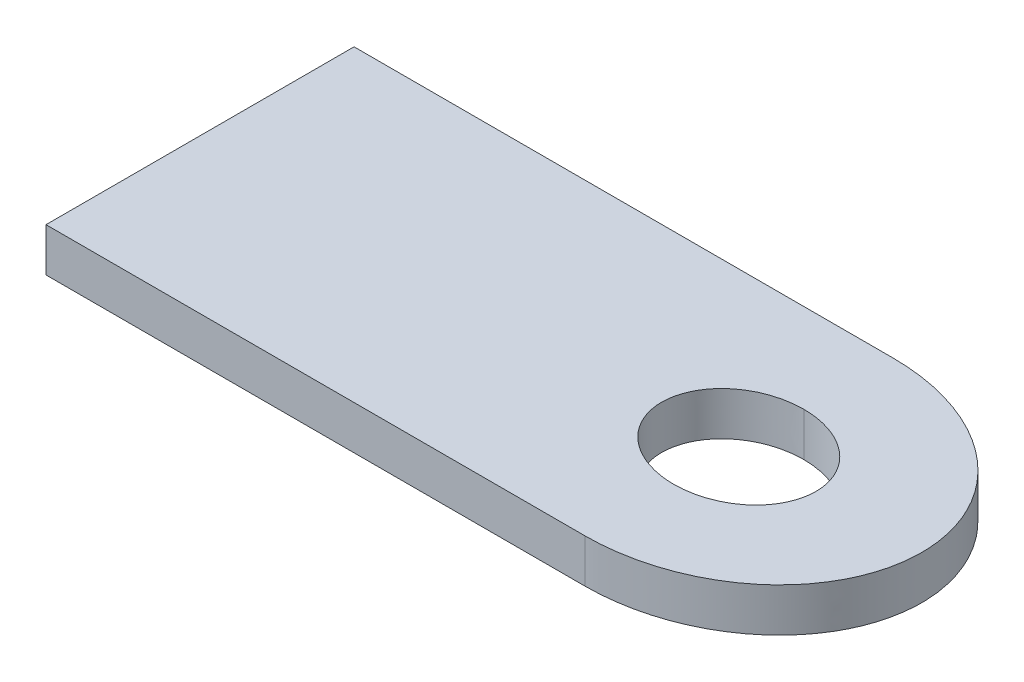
ISO-10303-21;
HEADER;
FILE_DESCRIPTION(('STEP AP214'),'2;1');
FILE_NAME('part.step','',(''),(''),'','','');
FILE_SCHEMA(('AUTOMOTIVE_DESIGN { 1 0 10303 214 1 1 1 1 }'));
ENDSEC;
DATA;
#1=APPLICATION_CONTEXT('core data for automotive mechanical design processes');
#2=APPLICATION_PROTOCOL_DEFINITION('international standard','automotive_design',2000,#1);
#3=PRODUCT_CONTEXT('',#1,'mechanical');
#4=PRODUCT('Part','Part','',(#3));
#5=PRODUCT_RELATED_PRODUCT_CATEGORY('part','',(#4));
#6=PRODUCT_DEFINITION_FORMATION('','',#4);
#7=PRODUCT_DEFINITION_CONTEXT('part definition',#1,'design');
#8=PRODUCT_DEFINITION('design','',#6,#7);
#9=PRODUCT_DEFINITION_SHAPE('','',#8);
#10=(LENGTH_UNIT() NAMED_UNIT(*) SI_UNIT(.MILLI.,.METRE.));
#11=(NAMED_UNIT(*) PLANE_ANGLE_UNIT() SI_UNIT($,.RADIAN.));
#12=(NAMED_UNIT(*) SI_UNIT($,.STERADIAN.) SOLID_ANGLE_UNIT());
#13=UNCERTAINTY_MEASURE_WITH_UNIT(LENGTH_MEASURE(1.E-05),#10,'distance_accuracy_value','');
#14=(GEOMETRIC_REPRESENTATION_CONTEXT(3) GLOBAL_UNCERTAINTY_ASSIGNED_CONTEXT((#13)) GLOBAL_UNIT_ASSIGNED_CONTEXT((#10,
#11,#12)) REPRESENTATION_CONTEXT('',''));
#15=CARTESIAN_POINT('',(0.,0.,0.));
#16=DIRECTION('',(0.,0.,1.));
#17=DIRECTION('',(1.,0.,0.));
#18=AXIS2_PLACEMENT_3D('',#15,#16,#17);
#19=CARTESIAN_POINT('',(68.9071258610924,10.,13.6261901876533));
#20=CARTESIAN_POINT('',(68.9071258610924,6.66666666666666,13.6261901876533));
#21=CARTESIAN_POINT('',(68.9071258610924,3.33333333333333,13.6261901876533));
#22=CARTESIAN_POINT('',(68.9071258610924,0.,13.6261901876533));
#23=CARTESIAN_POINT('',(65.8746050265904,10.,13.625383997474));
#24=CARTESIAN_POINT('',(65.8744519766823,6.66666666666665,13.6252988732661));
#25=CARTESIAN_POINT('',(65.8724623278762,3.33333333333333,13.6241922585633));
#26=CARTESIAN_POINT('',(65.8759824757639,0.,13.6261501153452));
#27=CARTESIAN_POINT('',(61.3629464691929,10.,12.6570491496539));
#28=CARTESIAN_POINT('',(61.3629343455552,6.66666666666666,12.6570424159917));
#29=CARTESIAN_POINT('',(61.3627767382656,3.33333333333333,12.6569548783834));
#30=CARTESIAN_POINT('',(61.3630555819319,0.,12.6571097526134));
#31=CARTESIAN_POINT('',(55.9835863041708,10.,9.24417294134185));
#32=CARTESIAN_POINT('',(55.9835892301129,6.66666666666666,9.2441745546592));
#33=CARTESIAN_POINT('',(55.9836272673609,3.33333333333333,9.24419552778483));
#34=CARTESIAN_POINT('',(55.9835599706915,0.,9.24415842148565));
#35=CARTESIAN_POINT('',(52.3400544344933,10.,5.03294937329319));
#36=CARTESIAN_POINT('',(52.340052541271,6.66666666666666,5.03294839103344));
#37=CARTESIAN_POINT('',(52.3400279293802,3.33333333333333,5.03293562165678));
#38=CARTESIAN_POINT('',(52.3400714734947,0.,5.03295821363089));
#39=CARTESIAN_POINT('',(50.538901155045,10.,-1.29647435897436));
#40=CARTESIAN_POINT('',(50.5389021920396,6.66666666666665,-1.29647435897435));
#41=CARTESIAN_POINT('',(50.5389156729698,3.33333333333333,-1.29647435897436));
#42=CARTESIAN_POINT('',(50.5388918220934,0.,-1.29647435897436));
#43=CARTESIAN_POINT('',(52.3400544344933,10.,-7.62589809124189));
#44=CARTESIAN_POINT('',(52.3400525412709,6.66666666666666,-7.62589710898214));
#45=CARTESIAN_POINT('',(52.3400279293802,3.33333333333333,-7.62588433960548));
#46=CARTESIAN_POINT('',(52.3400714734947,0.,-7.62590693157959));
#47=CARTESIAN_POINT('',(55.9835863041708,10.,-11.8371216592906));
#48=CARTESIAN_POINT('',(55.9835892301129,6.66666666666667,-11.8371232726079));
#49=CARTESIAN_POINT('',(55.9836272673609,3.33333333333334,-11.8371442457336));
#50=CARTESIAN_POINT('',(55.9835599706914,0.,-11.8371071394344));
#51=CARTESIAN_POINT('',(61.3629464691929,10.,-15.2499978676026));
#52=CARTESIAN_POINT('',(61.3629343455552,6.66666666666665,-15.2499911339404));
#53=CARTESIAN_POINT('',(61.3627767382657,3.33333333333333,-15.2499035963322));
#54=CARTESIAN_POINT('',(61.3630555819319,0.,-15.2500584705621));
#55=CARTESIAN_POINT('',(65.8746050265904,10.,-16.2183327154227));
#56=CARTESIAN_POINT('',(65.8744519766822,6.66666666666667,-16.2182475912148));
#57=CARTESIAN_POINT('',(65.8724623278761,3.33333333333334,-16.217140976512));
#58=CARTESIAN_POINT('',(65.8759824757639,0.,-16.2190988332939));
#59=CARTESIAN_POINT('',(68.9071258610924,10.,-16.219138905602));
#60=CARTESIAN_POINT('',(68.9071258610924,6.66666666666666,-16.219138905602));
#61=CARTESIAN_POINT('',(68.9071258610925,3.33333333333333,-16.219138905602));
#62=CARTESIAN_POINT('',(68.9071258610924,0.,-16.219138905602));
#63=B_SPLINE_SURFACE_WITH_KNOTS('',3,3,((#19,#20,#21,#22),(#23,#24,#25,#26),(#27,#28,#29,#30),
(#31,#32,#33,#34),(#35,#36,#37,#38),(#39,#40,#41,#42),(#43,#44,#45,#46),(#47,#48,#49,#50),(#51,
#52,#53,#54),(#55,#56,#57,#58),(#59,#60,#61,#62)),.UNSPECIFIED.,.F.,.F.,.F.,(4,1,1,1,1,1,1,1,4),
(4,4),(0.,0.178093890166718,0.263499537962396,0.370459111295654,0.5,0.629540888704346,
0.736500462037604,0.821906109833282,1.),(0.,1.),.UNSPECIFIED.);
#64=CARTESIAN_POINT('',(68.9071258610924,9.99999999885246,-16.219138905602));
#65=CARTESIAN_POINT('',(65.8746050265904,9.99999999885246,-16.2183327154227));
#66=CARTESIAN_POINT('',(61.3629464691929,9.99999999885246,-15.2499978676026));
#67=CARTESIAN_POINT('',(55.9835863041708,9.99999999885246,-11.8371216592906));
#68=CARTESIAN_POINT('',(52.3400544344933,9.99999999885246,-7.62589809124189));
#69=CARTESIAN_POINT('',(50.538901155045,9.99999999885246,-1.29647435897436));
#70=CARTESIAN_POINT('',(52.3400544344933,9.99999999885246,5.03294937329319));
#71=CARTESIAN_POINT('',(55.9835863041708,9.99999999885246,9.24417294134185));
#72=CARTESIAN_POINT('',(61.3629464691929,9.99999999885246,12.6570491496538));
#73=CARTESIAN_POINT('',(65.8746050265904,9.99999999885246,13.6253839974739));
#74=CARTESIAN_POINT('',(68.9071258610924,9.99999999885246,13.6261901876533));
#75=B_SPLINE_CURVE_WITH_KNOTS('',3,(#64,#65,#66,#67,#68,#69,#70,#71,#72,#73,#74),.UNSPECIFIED.,
.F.,.F.,(4,1,1,1,1,1,1,1,4),(0.,0.178093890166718,0.263499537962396,0.370459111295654,0.5,
0.629540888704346,0.736500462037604,0.821906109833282,1.),.UNSPECIFIED.);
#76=CARTESIAN_POINT('',(68.9071258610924,10.,-16.219138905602));
#77=VERTEX_POINT('',#76);
#78=CARTESIAN_POINT('',(68.9071258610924,10.,13.6261901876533));
#79=VERTEX_POINT('',#78);
#80=EDGE_CURVE('E13',#77,#79,#75,.T.);
#81=DIRECTION('',(0.,-1.,0.));
#82=VECTOR('',#81,1.);
#83=CARTESIAN_POINT('',(68.9071258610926,4.99999999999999,13.6261901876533));
#84=LINE('',#83,#82);
#85=CARTESIAN_POINT('',(68.9071258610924,0.,13.6261901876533));
#86=VERTEX_POINT('',#85);
#87=EDGE_CURVE('E154',#79,#86,#84,.T.);
#88=CARTESIAN_POINT('',(68.9071258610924,3.40516326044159E-08,13.6261901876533));
#89=CARTESIAN_POINT('',(65.8759824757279,3.40516326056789E-08,13.6261501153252));
#90=CARTESIAN_POINT('',(61.363055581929,3.40516326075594E-08,12.6571097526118));
#91=CARTESIAN_POINT('',(55.9835599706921,3.40516326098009E-08,9.24415842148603));
#92=CARTESIAN_POINT('',(52.3400714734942,3.40516326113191E-08,5.03295821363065));
#93=CARTESIAN_POINT('',(50.5388918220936,3.40516326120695E-08,-1.29647435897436));
#94=CARTESIAN_POINT('',(52.3400714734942,3.4051632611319E-08,-7.62590693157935));
#95=CARTESIAN_POINT('',(55.9835599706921,3.40516326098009E-08,-11.8371071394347));
#96=CARTESIAN_POINT('',(61.363055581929,3.40516326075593E-08,-15.2500584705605));
#97=CARTESIAN_POINT('',(65.8759824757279,3.4051632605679E-08,-16.2190988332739));
#98=CARTESIAN_POINT('',(68.9071258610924,3.40516326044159E-08,-16.219138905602));
#99=B_SPLINE_CURVE_WITH_KNOTS('',3,(#88,#89,#90,#91,#92,#93,#94,#95,#96,#97,#98),.UNSPECIFIED.,
.F.,.F.,(4,1,1,1,1,1,1,1,4),(0.,0.178093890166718,0.263499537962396,0.370459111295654,0.5,
0.629540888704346,0.736500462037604,0.821906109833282,1.),.UNSPECIFIED.);
#100=CARTESIAN_POINT('',(68.9071258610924,0.,-16.219138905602));
#101=VERTEX_POINT('',#100);
#102=EDGE_CURVE('E224',#101,#86,#99,.F.);
#103=DIRECTION('',(0.,-1.,0.));
#104=VECTOR('',#103,1.);
#105=CARTESIAN_POINT('',(68.9071258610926,4.99999999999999,-16.2191389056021));
#106=LINE('',#105,#104);
#107=EDGE_CURVE('E378',#77,#101,#106,.T.);
#108=ORIENTED_EDGE('',*,*,#80,.T.);
#109=ORIENTED_EDGE('',*,*,#87,.T.);
#110=ORIENTED_EDGE('',*,*,#102,.F.);
#111=ORIENTED_EDGE('',*,*,#107,.F.);
#112=EDGE_LOOP('',(#108,#109,#110,#111));
#113=FACE_BOUND('',#112,.T.);
#114=ADVANCED_FACE('F142',(#113),#63,.F.);
#115=CARTESIAN_POINT('',(61.1935897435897,10.,-1.29647435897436));
#116=DIRECTION('',(0.,1.,0.));
#117=DIRECTION('',(0.,0.,1.));
#118=AXIS2_PLACEMENT_3D('',#115,#116,#117);
#119=PLANE('',#118);
#120=DIRECTION('',(0.,0.,1.));
#121=VECTOR('',#120,1.);
#122=CARTESIAN_POINT('',(-54.7391864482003,9.99999999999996,-1.29647435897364));
#123=LINE('',#122,#121);
#124=CARTESIAN_POINT('',(-54.7391864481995,10.,-36.6470085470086));
#125=VERTEX_POINT('',#124);
#126=CARTESIAN_POINT('',(-54.7391864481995,10.,34.0540598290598));
#127=VERTEX_POINT('',#126);
#128=EDGE_CURVE('E227',#125,#127,#123,.T.);
#129=ORIENTED_EDGE('',*,*,#128,.T.);
#130=DIRECTION('',(1.,0.,0.));
#131=VECTOR('',#130,1.);
#132=CARTESIAN_POINT('',(7.08396970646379,9.99999999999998,34.0540598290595));
#133=LINE('',#132,#131);
#134=CARTESIAN_POINT('',(68.9071258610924,10.,34.0540598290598));
#135=VERTEX_POINT('',#134);
#136=EDGE_CURVE('E204',#127,#135,#133,.T.);
#137=ORIENTED_EDGE('',*,*,#136,.T.);
#138=CARTESIAN_POINT('',(68.9071258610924,9.99999999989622,-36.6470085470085));
#139=CARTESIAN_POINT('',(74.7994223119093,9.99999999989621,-36.6468387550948));
#140=CARTESIAN_POINT('',(85.469885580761,9.99999999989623,-34.7650812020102));
#141=CARTESIAN_POINT('',(97.0860499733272,9.99999999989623,-28.1613458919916));
#142=CARTESIAN_POINT('',(103.932171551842,9.99999999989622,-21.2199386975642));
#143=CARTESIAN_POINT('',(107.895508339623,9.99999999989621,-15.0546870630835));
#144=CARTESIAN_POINT('',(110.35303853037,9.99999999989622,-8.32354724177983));
#145=CARTESIAN_POINT('',(111.186375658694,9.99999999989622,-1.29647435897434));
#146=CARTESIAN_POINT('',(110.35303853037,9.99999999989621,5.73059852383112));
#147=CARTESIAN_POINT('',(107.895508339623,9.99999999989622,12.4617383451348));
#148=CARTESIAN_POINT('',(103.932171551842,9.99999999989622,18.6269899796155));
#149=CARTESIAN_POINT('',(97.0860499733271,9.99999999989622,25.5683971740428));
#150=CARTESIAN_POINT('',(85.4698855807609,9.99999999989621,32.1721324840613));
#151=CARTESIAN_POINT('',(74.7994223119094,9.99999999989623,34.0538900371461));
#152=CARTESIAN_POINT('',(68.9071258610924,9.99999999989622,34.0540598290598));
#153=B_SPLINE_CURVE_WITH_KNOTS('',3,(#138,#139,#140,#141,#142,#143,#144,#145,#146,#147,#148,
#149,#150,#151,#152),.UNSPECIFIED.,.F.,.F.,(4,1,1,1,1,1,1,1,1,1,1,1,4),(0.,0.145372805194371,
0.263093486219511,0.324673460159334,0.384370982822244,0.442591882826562,0.5,0.557408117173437,
0.615629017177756,0.675326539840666,0.736906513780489,0.854627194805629,1.),.UNSPECIFIED.);
#154=CARTESIAN_POINT('',(68.9071258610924,10.,-36.6470085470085));
#155=VERTEX_POINT('',#154);
#156=EDGE_CURVE('E367',#135,#155,#153,.F.);
#157=ORIENTED_EDGE('',*,*,#156,.T.);
#158=DIRECTION('',(-1.,0.,0.));
#159=VECTOR('',#158,1.);
#160=CARTESIAN_POINT('',(7.08396970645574,9.99999999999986,-36.6470085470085));
#161=LINE('',#160,#159);
#162=EDGE_CURVE('E373',#155,#125,#161,.T.);
#163=ORIENTED_EDGE('',*,*,#162,.T.);
#164=EDGE_LOOP('',(#129,#137,#157,#163));
#165=FACE_BOUND('',#164,.T.);
#166=ORIENTED_EDGE('',*,*,#80,.F.);
#167=CARTESIAN_POINT('',(68.9071258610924,9.99999999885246,13.6261901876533));
#168=CARTESIAN_POINT('',(71.9396466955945,9.99999999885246,13.625383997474));
#169=CARTESIAN_POINT('',(76.4513052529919,9.99999999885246,12.6570491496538));
#170=CARTESIAN_POINT('',(81.830665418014,9.99999999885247,9.24417294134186));
#171=CARTESIAN_POINT('',(85.4741972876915,9.99999999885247,5.03294937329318));
#172=CARTESIAN_POINT('',(87.2753505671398,9.99999999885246,-1.29647435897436));
#173=CARTESIAN_POINT('',(85.4741972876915,9.99999999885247,-7.6258980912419));
#174=CARTESIAN_POINT('',(81.830665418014,9.99999999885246,-11.8371216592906));
#175=CARTESIAN_POINT('',(76.4513052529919,9.99999999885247,-15.2499978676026));
#176=CARTESIAN_POINT('',(71.9396466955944,9.99999999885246,-16.2183327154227));
#177=CARTESIAN_POINT('',(68.9071258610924,9.99999999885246,-16.219138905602));
#178=B_SPLINE_CURVE_WITH_KNOTS('',3,(#167,#168,#169,#170,#171,#172,#173,#174,#175,#176,#177),
.UNSPECIFIED.,.F.,.F.,(4,1,1,1,1,1,1,1,4),(0.,0.178093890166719,0.263499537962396,
0.370459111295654,0.5,0.629540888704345,0.736500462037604,0.821906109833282,1.),.UNSPECIFIED.);
#179=EDGE_CURVE('E305',#79,#77,#178,.T.);
#180=ORIENTED_EDGE('',*,*,#179,.F.);
#181=EDGE_LOOP('',(#166,#180));
#182=FACE_BOUND('',#181,.T.);
#183=ADVANCED_FACE('F247',(#165,#182),#119,.T.);
#184=CARTESIAN_POINT('',(61.1935897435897,0.,-1.29647435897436));
#185=DIRECTION('',(0.,1.,0.));
#186=DIRECTION('',(0.,0.,1.));
#187=AXIS2_PLACEMENT_3D('',#184,#185,#186);
#188=PLANE('',#187);
#189=DIRECTION('',(0.,0.,1.));
#190=VECTOR('',#189,1.);
#191=CARTESIAN_POINT('',(-54.7391864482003,0.,-1.29647435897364));
#192=LINE('',#191,#190);
#193=CARTESIAN_POINT('',(-54.7391864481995,0.,-36.6470085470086));
#194=VERTEX_POINT('',#193);
#195=CARTESIAN_POINT('',(-54.7391864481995,0.,34.0540598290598));
#196=VERTEX_POINT('',#195);
#197=EDGE_CURVE('E216',#194,#196,#192,.T.);
#198=ORIENTED_EDGE('',*,*,#197,.F.);
#199=DIRECTION('',(-1.,0.,0.));
#200=VECTOR('',#199,1.);
#201=CARTESIAN_POINT('',(7.08396970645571,0.,-36.6470085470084));
#202=LINE('',#201,#200);
#203=CARTESIAN_POINT('',(68.9071258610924,0.,-36.6470085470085));
#204=VERTEX_POINT('',#203);
#205=EDGE_CURVE('E299',#204,#194,#202,.T.);
#206=ORIENTED_EDGE('',*,*,#205,.F.);
#207=CARTESIAN_POINT('',(68.9071258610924,2.27469374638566E-09,34.0540598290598));
#208=CARTESIAN_POINT('',(74.7978420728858,2.27469374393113E-09,34.0541377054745));
#209=CARTESIAN_POINT('',(85.4703612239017,2.27469373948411E-09,32.172057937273));
#210=CARTESIAN_POINT('',(97.0860485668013,2.2746937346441E-09,25.568397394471));
#211=CARTESIAN_POINT('',(103.932171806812,2.27469373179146E-09,18.6269899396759));
#212=CARTESIAN_POINT('',(107.895508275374,2.27469373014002E-09,12.4617383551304));
#213=CARTESIAN_POINT('',(110.35303854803,2.27469372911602E-09,5.73059852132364));
#214=CARTESIAN_POINT('',(111.186375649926,2.27469372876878E-09,-1.29647435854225));
#215=CARTESIAN_POINT('',(110.35303854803,2.27469372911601E-09,-8.32354724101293));
#216=CARTESIAN_POINT('',(107.895508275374,2.27469373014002E-09,-15.0546870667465));
#217=CARTESIAN_POINT('',(103.932171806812,2.27469373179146E-09,-21.2199386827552));
#218=CARTESIAN_POINT('',(97.0860485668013,2.27469373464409E-09,-28.1613459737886));
#219=CARTESIAN_POINT('',(85.4703612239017,2.27469373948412E-09,-34.7650535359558));
#220=CARTESIAN_POINT('',(74.7978420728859,2.27469374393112E-09,-36.6469306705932));
#221=CARTESIAN_POINT('',(68.9071258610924,2.27469374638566E-09,-36.6470085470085));
#222=B_SPLINE_CURVE_WITH_KNOTS('',3,(#207,#208,#209,#210,#211,#212,#213,#214,#215,#216,#217,
#218,#219,#220,#221),.UNSPECIFIED.,.F.,.F.,(4,1,1,1,1,1,1,1,1,1,1,1,4),(0.,0.145372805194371,
0.263093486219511,0.324673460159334,0.384370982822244,0.442591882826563,0.5,0.557408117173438,
0.615629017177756,0.675326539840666,0.736906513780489,0.854627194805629,1.),.UNSPECIFIED.);
#223=CARTESIAN_POINT('',(68.9071258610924,0.,34.0540598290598));
#224=VERTEX_POINT('',#223);
#225=EDGE_CURVE('E209',#224,#204,#222,.T.);
#226=ORIENTED_EDGE('',*,*,#225,.F.);
#227=DIRECTION('',(1.,0.,0.));
#228=VECTOR('',#227,1.);
#229=CARTESIAN_POINT('',(7.08396970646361,0.,34.0540598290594));
#230=LINE('',#229,#228);
#231=EDGE_CURVE('E202',#196,#224,#230,.T.);
#232=ORIENTED_EDGE('',*,*,#231,.F.);
#233=EDGE_LOOP('',(#198,#206,#226,#232));
#234=FACE_BOUND('',#233,.T.);
#235=ORIENTED_EDGE('',*,*,#102,.T.);
#236=CARTESIAN_POINT('',(68.9071258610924,3.4140046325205E-08,-16.219138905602));
#237=CARTESIAN_POINT('',(71.938269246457,3.41400463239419E-08,-16.2190988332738));
#238=CARTESIAN_POINT('',(76.4511961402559,3.41400463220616E-08,-15.2500584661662));
#239=CARTESIAN_POINT('',(81.8306917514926,3.41400463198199E-08,-11.837107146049));
#240=CARTESIAN_POINT('',(85.4741802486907,3.41400463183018E-08,-7.62590689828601));
#241=CARTESIAN_POINT('',(87.2753599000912,3.41400463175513E-08,-1.29647463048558));
#242=CARTESIAN_POINT('',(85.4741802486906,3.41400463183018E-08,5.03295917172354));
#243=CARTESIAN_POINT('',(81.8306917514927,3.414004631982E-08,9.24415689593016));
#244=CARTESIAN_POINT('',(76.4511961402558,3.41400463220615E-08,12.6571160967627));
#245=CARTESIAN_POINT('',(71.938269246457,3.4140046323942E-08,13.6262302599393));
#246=CARTESIAN_POINT('',(68.9071258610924,3.4140046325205E-08,13.6261901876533));
#247=B_SPLINE_CURVE_WITH_KNOTS('',3,(#236,#237,#238,#239,#240,#241,#242,#243,#244,#245,#246),
.UNSPECIFIED.,.F.,.F.,(4,1,1,1,1,1,1,1,4),(0.,0.178093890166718,0.263499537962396,
0.370459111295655,0.5,0.629540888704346,0.736500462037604,0.821906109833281,1.),.UNSPECIFIED.);
#248=EDGE_CURVE('E221',#86,#101,#247,.F.);
#249=ORIENTED_EDGE('',*,*,#248,.T.);
#250=EDGE_LOOP('',(#235,#249));
#251=FACE_BOUND('',#250,.T.);
#252=ADVANCED_FACE('F213',(#234,#251),#188,.F.);
#253=CARTESIAN_POINT('',(-54.7391864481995,0.,34.0540598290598));
#254=DIRECTION('',(1.,0.,0.));
#255=DIRECTION('',(0.,0.,-1.));
#256=AXIS2_PLACEMENT_3D('',#253,#254,#255);
#257=PLANE('',#256);
#258=ORIENTED_EDGE('',*,*,#197,.T.);
#259=DIRECTION('',(0.,-1.,0.));
#260=VECTOR('',#259,1.);
#261=CARTESIAN_POINT('',(-54.7391864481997,4.99999999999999,34.0540598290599));
#262=LINE('',#261,#260);
#263=EDGE_CURVE('E199',#127,#196,#262,.T.);
#264=ORIENTED_EDGE('',*,*,#263,.F.);
#265=ORIENTED_EDGE('',*,*,#128,.F.);
#266=DIRECTION('',(0.,-1.,0.));
#267=VECTOR('',#266,1.);
#268=CARTESIAN_POINT('',(-54.7391864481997,5.,-36.6470085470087));
#269=LINE('',#268,#267);
#270=EDGE_CURVE('E218',#125,#194,#269,.T.);
#271=ORIENTED_EDGE('',*,*,#270,.T.);
#272=EDGE_LOOP('',(#258,#264,#265,#271));
#273=FACE_BOUND('',#272,.T.);
#274=ADVANCED_FACE('F144',(#273),#257,.F.);
#275=CARTESIAN_POINT('',(-42.8700854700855,10.,34.0540598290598));
#276=DIRECTION('',(0.,0.,-1.));
#277=DIRECTION('',(-1.,0.,0.));
#278=AXIS2_PLACEMENT_3D('',#275,#276,#277);
#279=PLANE('',#278);
#280=ORIENTED_EDGE('',*,*,#231,.T.);
#281=DIRECTION('',(0.,-1.,0.));
#282=VECTOR('',#281,1.);
#283=CARTESIAN_POINT('',(68.9071258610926,4.99999999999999,34.0540598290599));
#284=LINE('',#283,#282);
#285=EDGE_CURVE('E193',#135,#224,#284,.T.);
#286=ORIENTED_EDGE('',*,*,#285,.F.);
#287=ORIENTED_EDGE('',*,*,#136,.F.);
#288=ORIENTED_EDGE('',*,*,#263,.T.);
#289=EDGE_LOOP('',(#280,#286,#287,#288));
#290=FACE_BOUND('',#289,.T.);
#291=ADVANCED_FACE('F201',(#290),#279,.F.);
#292=CARTESIAN_POINT('',(68.9071258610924,10.,-36.6470085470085));
#293=CARTESIAN_POINT('',(68.9071258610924,6.66666666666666,-36.6470085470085));
#294=CARTESIAN_POINT('',(68.9071258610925,3.33333333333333,-36.6470085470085));
#295=CARTESIAN_POINT('',(68.9071258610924,0.,-36.6470085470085));
#296=CARTESIAN_POINT('',(74.7994223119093,9.99999999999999,-36.6468387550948));
#297=CARTESIAN_POINT('',(74.7995978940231,6.66666666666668,-36.6468285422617));
#298=CARTESIAN_POINT('',(74.8018804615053,3.33333333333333,-36.6466957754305));
#299=CARTESIAN_POINT('',(74.7978420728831,0.,-36.6469306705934));
#300=CARTESIAN_POINT('',(85.469885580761,10.,-34.7650812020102));
#301=CARTESIAN_POINT('',(85.469832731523,6.66666666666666,-34.7650842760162));
#302=CARTESIAN_POINT('',(85.4691456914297,3.33333333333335,-34.7651242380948));
#303=CARTESIAN_POINT('',(85.4703612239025,0.,-34.7650535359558));
#304=CARTESIAN_POINT('',(97.0860499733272,10.,-28.1613458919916));
#305=CARTESIAN_POINT('',(97.0860501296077,6.66666666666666,-28.161345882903));
#306=CARTESIAN_POINT('',(97.0860521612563,3.33333333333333,-28.1613457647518));
#307=CARTESIAN_POINT('',(97.0860485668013,0.,-28.1613459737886));
#308=CARTESIAN_POINT('',(103.932171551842,10.,-21.2199386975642));
#309=CARTESIAN_POINT('',(103.932171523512,6.66666666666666,-21.2199386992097));
#310=CARTESIAN_POINT('',(103.932171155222,3.33333333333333,-21.2199387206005));
#311=CARTESIAN_POINT('',(103.932171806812,0.,-21.2199386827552));
#312=CARTESIAN_POINT('',(107.895508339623,10.,-15.0546870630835));
#313=CARTESIAN_POINT('',(107.895508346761,6.66666666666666,-15.0546870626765));
#314=CARTESIAN_POINT('',(107.895508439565,3.33333333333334,-15.0546870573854));
#315=CARTESIAN_POINT('',(107.895508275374,0.,-15.0546870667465));
#316=CARTESIAN_POINT('',(110.35303853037,10.,-8.32354724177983));
#317=CARTESIAN_POINT('',(110.353038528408,6.66666666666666,-8.32354724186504));
#318=CARTESIAN_POINT('',(110.3530385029,3.33333333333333,-8.32354724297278));
#319=CARTESIAN_POINT('',(110.35303854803,0.,-8.32354724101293));
#320=CARTESIAN_POINT('',(111.186375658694,10.,-1.29647435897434));
#321=CARTESIAN_POINT('',(111.186375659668,6.66666666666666,-1.29647435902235));
#322=CARTESIAN_POINT('',(111.186375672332,3.33333333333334,-1.29647435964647));
#323=CARTESIAN_POINT('',(111.186375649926,0.,-1.29647435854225));
#324=CARTESIAN_POINT('',(110.35303853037,9.99999999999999,5.73059852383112));
#325=CARTESIAN_POINT('',(110.353038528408,6.66666666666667,5.73059852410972));
#326=CARTESIAN_POINT('',(110.3530385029,3.33333333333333,5.73059852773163));
#327=CARTESIAN_POINT('',(110.35303854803,0.,5.73059852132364));
#328=CARTESIAN_POINT('',(107.895508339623,10.,12.4617383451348));
#329=CARTESIAN_POINT('',(107.895508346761,6.66666666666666,12.4617383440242));
#330=CARTESIAN_POINT('',(107.895508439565,3.33333333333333,12.4617383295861));
#331=CARTESIAN_POINT('',(107.895508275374,0.,12.4617383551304));
#332=CARTESIAN_POINT('',(103.932171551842,10.,18.6269899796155));
#333=CARTESIAN_POINT('',(103.932171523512,6.66666666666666,18.6269899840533));
#334=CARTESIAN_POINT('',(103.932171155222,3.33333333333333,18.6269900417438));
#335=CARTESIAN_POINT('',(103.932171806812,0.,18.6269899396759));
#336=CARTESIAN_POINT('',(97.0860499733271,10.,25.5683971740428));
#337=CARTESIAN_POINT('',(97.0860501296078,6.66666666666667,25.5683971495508));
#338=CARTESIAN_POINT('',(97.0860521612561,3.33333333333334,25.5683968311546));
#339=CARTESIAN_POINT('',(97.0860485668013,0.,25.568397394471));
#340=CARTESIAN_POINT('',(85.4698855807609,9.99999999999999,32.1721324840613));
#341=CARTESIAN_POINT('',(85.4698327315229,6.66666666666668,32.1721407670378));
#342=CARTESIAN_POINT('',(85.4691456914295,3.33333333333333,32.1722484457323));
#343=CARTESIAN_POINT('',(85.4703612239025,0.,32.1720579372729));
#344=CARTESIAN_POINT('',(74.7994223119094,10.,34.0538900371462));
#345=CARTESIAN_POINT('',(74.7995978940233,6.6666666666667,34.053862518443));
#346=CARTESIAN_POINT('',(74.8018804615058,3.33333333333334,34.0535047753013));
#347=CARTESIAN_POINT('',(74.797842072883,0.,34.054137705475));
#348=CARTESIAN_POINT('',(68.9071258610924,10.,34.0540598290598));
#349=CARTESIAN_POINT('',(68.9071258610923,6.66666666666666,34.0540598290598));
#350=CARTESIAN_POINT('',(68.9071258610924,3.33333333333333,34.0540598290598));
#351=CARTESIAN_POINT('',(68.9071258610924,0.,34.0540598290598));
#352=B_SPLINE_SURFACE_WITH_KNOTS('',3,3,((#292,#293,#294,#295),(#296,#297,#298,#299),(#300,#301,
#302,#303),(#304,#305,#306,#307),(#308,#309,#310,#311),(#312,#313,#314,#315),(#316,#317,#318,
#319),(#320,#321,#322,#323),(#324,#325,#326,#327),(#328,#329,#330,#331),(#332,#333,#334,#335),
(#336,#337,#338,#339),(#340,#341,#342,#343),(#344,#345,#346,#347),(#348,#349,#350,#351)),
.UNSPECIFIED.,.F.,.F.,.F.,(4,1,1,1,1,1,1,1,1,1,1,1,4),(4,4),(0.,0.145372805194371,
0.263093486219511,0.324673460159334,0.384370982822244,0.442591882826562,0.5,0.557408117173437,
0.615629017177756,0.675326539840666,0.736906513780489,0.854627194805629,1.),(0.,1.),.UNSPECIFIED.);
#353=DIRECTION('',(0.,-1.,0.));
#354=VECTOR('',#353,1.);
#355=CARTESIAN_POINT('',(68.9071258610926,4.99999999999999,-36.6470085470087));
#356=LINE('',#355,#354);
#357=EDGE_CURVE('E301',#155,#204,#356,.T.);
#358=ORIENTED_EDGE('',*,*,#225,.T.);
#359=ORIENTED_EDGE('',*,*,#357,.F.);
#360=ORIENTED_EDGE('',*,*,#156,.F.);
#361=ORIENTED_EDGE('',*,*,#285,.T.);
#362=EDGE_LOOP('',(#358,#359,#360,#361));
#363=FACE_BOUND('',#362,.T.);
#364=ADVANCED_FACE('F336',(#363),#352,.T.);
#365=CARTESIAN_POINT('',(-42.8700854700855,10.,-36.6470085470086));
#366=DIRECTION('',(0.,0.,1.));
#367=DIRECTION('',(1.,0.,0.));
#368=AXIS2_PLACEMENT_3D('',#365,#366,#367);
#369=PLANE('',#368);
#370=ORIENTED_EDGE('',*,*,#205,.T.);
#371=ORIENTED_EDGE('',*,*,#270,.F.);
#372=ORIENTED_EDGE('',*,*,#162,.F.);
#373=ORIENTED_EDGE('',*,*,#357,.T.);
#374=EDGE_LOOP('',(#370,#371,#372,#373));
#375=FACE_BOUND('',#374,.T.);
#376=ADVANCED_FACE('F319',(#375),#369,.F.);
#377=CARTESIAN_POINT('',(68.9071258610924,10.,-16.219138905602));
#378=CARTESIAN_POINT('',(68.9071258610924,6.66666666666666,-16.219138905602));
#379=CARTESIAN_POINT('',(68.9071258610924,3.33333333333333,-16.219138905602));
#380=CARTESIAN_POINT('',(68.9071258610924,0.,-16.219138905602));
#381=CARTESIAN_POINT('',(71.9396466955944,10.,-16.2183327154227));
#382=CARTESIAN_POINT('',(71.9397997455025,6.66666666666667,-16.2182475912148));
#383=CARTESIAN_POINT('',(71.9417893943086,3.33333333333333,-16.2171409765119));
#384=CARTESIAN_POINT('',(71.9382692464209,0.,-16.2190988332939));
#385=CARTESIAN_POINT('',(76.4513052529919,10.,-15.2499978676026));
#386=CARTESIAN_POINT('',(76.4513173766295,6.66666666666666,-15.2499911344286));
#387=CARTESIAN_POINT('',(76.4514749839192,3.33333333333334,-15.2499036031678));
#388=CARTESIAN_POINT('',(76.451196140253,0.,-15.2500584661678));
#389=CARTESIAN_POINT('',(81.830665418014,10.,-11.8371216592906));
#390=CARTESIAN_POINT('',(81.8306624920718,6.66666666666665,-11.837123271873));
#391=CARTESIAN_POINT('',(81.8306244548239,3.33333333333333,-11.8371442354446));
#392=CARTESIAN_POINT('',(81.8306917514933,0.,-11.8371071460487));
#393=CARTESIAN_POINT('',(85.4741972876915,10.,-7.6258980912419));
#394=CARTESIAN_POINT('',(85.4741991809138,6.66666666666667,-7.62589711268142));
#395=CARTESIAN_POINT('',(85.4742237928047,3.33333333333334,-7.62588439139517));
#396=CARTESIAN_POINT('',(85.4741802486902,0.,-7.62590689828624));
#397=CARTESIAN_POINT('',(87.2753505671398,9.99999999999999,-1.29647435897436));
#398=CARTESIAN_POINT('',(87.2753495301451,6.66666666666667,-1.29647432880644));
#399=CARTESIAN_POINT('',(87.275336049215,3.33333333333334,-1.29647393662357));
#400=CARTESIAN_POINT('',(87.2753599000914,0.,-1.29647463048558));
#401=CARTESIAN_POINT('',(85.4741972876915,10.,5.03294937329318));
#402=CARTESIAN_POINT('',(85.4741991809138,6.66666666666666,5.03294828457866));
#403=CARTESIAN_POINT('',(85.4742237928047,3.33333333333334,5.03293413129));
#404=CARTESIAN_POINT('',(85.4741802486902,0.,5.0329591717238));
#405=CARTESIAN_POINT('',(81.830665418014,10.,9.24417294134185));
#406=CARTESIAN_POINT('',(81.8306624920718,6.66666666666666,9.24417472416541));
#407=CARTESIAN_POINT('',(81.8306244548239,3.33333333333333,9.2441979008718));
#408=CARTESIAN_POINT('',(81.8306917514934,0.,9.24415689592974));
#409=CARTESIAN_POINT('',(76.4513052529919,10.,12.6570491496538));
#410=CARTESIAN_POINT('',(76.4513173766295,6.66666666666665,12.657041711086));
#411=CARTESIAN_POINT('',(76.4514749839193,3.33333333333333,12.656945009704));
#412=CARTESIAN_POINT('',(76.4511961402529,0.,12.6571160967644));
#413=CARTESIAN_POINT('',(71.9396466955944,10.,13.625383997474));
#414=CARTESIAN_POINT('',(71.9397997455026,6.66666666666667,13.6252899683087));
#415=CARTESIAN_POINT('',(71.9417893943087,3.33333333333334,13.6240675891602));
#416=CARTESIAN_POINT('',(71.938269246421,0.,13.6262302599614));
#417=CARTESIAN_POINT('',(68.9071258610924,10.,13.6261901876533));
#418=CARTESIAN_POINT('',(68.9071258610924,6.66666666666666,13.6261901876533));
#419=CARTESIAN_POINT('',(68.9071258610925,3.33333333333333,13.6261901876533));
#420=CARTESIAN_POINT('',(68.9071258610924,0.,13.6261901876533));
#421=B_SPLINE_SURFACE_WITH_KNOTS('',3,3,((#377,#378,#379,#380),(#381,#382,#383,#384),(#385,#386,
#387,#388),(#389,#390,#391,#392),(#393,#394,#395,#396),(#397,#398,#399,#400),(#401,#402,#403,
#404),(#405,#406,#407,#408),(#409,#410,#411,#412),(#413,#414,#415,#416),(#417,#418,#419,#420)),
.UNSPECIFIED.,.F.,.F.,.F.,(4,1,1,1,1,1,1,1,4),(4,4),(0.,0.178093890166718,0.263499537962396,
0.370459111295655,0.5,0.629540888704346,0.736500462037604,0.821906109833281,1.),(0.,1.),.UNSPECIFIED.);
#422=ORIENTED_EDGE('',*,*,#87,.F.);
#423=ORIENTED_EDGE('',*,*,#179,.T.);
#424=ORIENTED_EDGE('',*,*,#107,.T.);
#425=ORIENTED_EDGE('',*,*,#248,.F.);
#426=EDGE_LOOP('',(#422,#423,#424,#425));
#427=FACE_BOUND('',#426,.T.);
#428=ADVANCED_FACE('F308',(#427),#421,.F.);
#429=CLOSED_SHELL('',(#114,#183,#252,#274,#291,#364,#376,#428));
#430=MANIFOLD_SOLID_BREP('B2',#429);
#431=ADVANCED_BREP_SHAPE_REPRESENTATION('',(#18,#430),#14);
#432=SHAPE_DEFINITION_REPRESENTATION(#9,#431);
ENDSEC;
END-ISO-10303-21;
